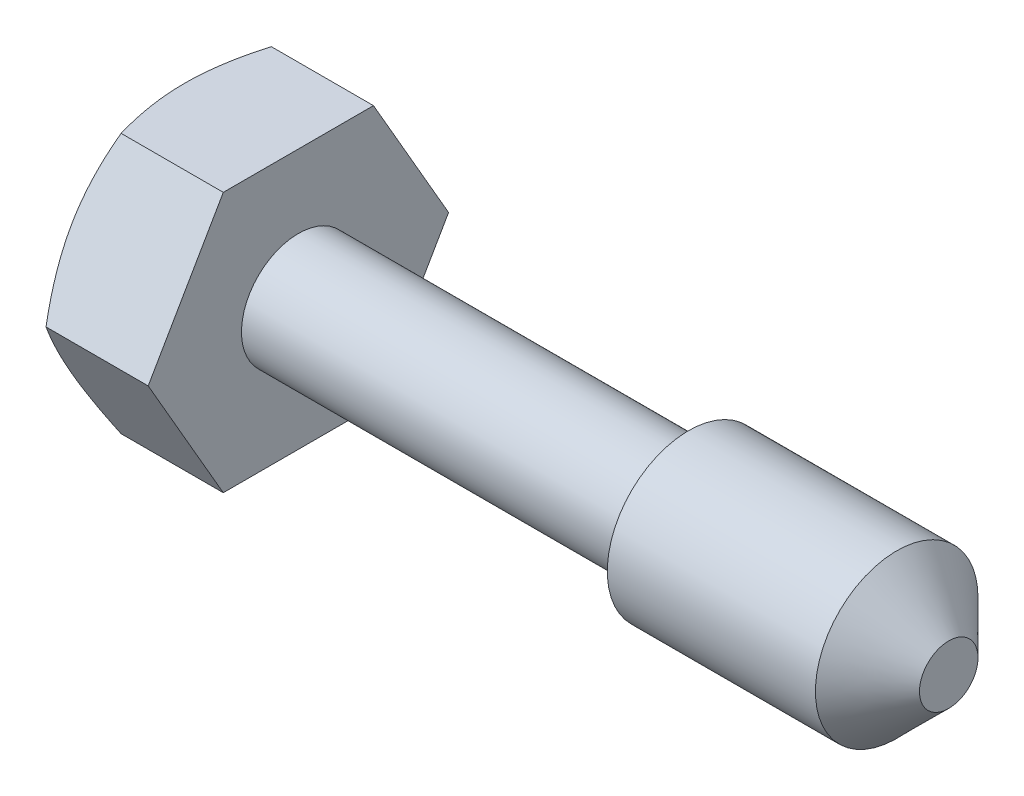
ISO-10303-21;
HEADER;
FILE_DESCRIPTION(('STEP AP214'),'2;1');
FILE_NAME('part.step','',(''),(''),'','','');
FILE_SCHEMA(('AUTOMOTIVE_DESIGN { 1 0 10303 214 1 1 1 1 }'));
ENDSEC;
DATA;
#1=APPLICATION_CONTEXT('core data for automotive mechanical design processes');
#2=APPLICATION_PROTOCOL_DEFINITION('international standard','automotive_design',2000,#1);
#3=PRODUCT_CONTEXT('',#1,'mechanical');
#4=PRODUCT('Part','Part','',(#3));
#5=PRODUCT_RELATED_PRODUCT_CATEGORY('part','',(#4));
#6=PRODUCT_DEFINITION_FORMATION('','',#4);
#7=PRODUCT_DEFINITION_CONTEXT('part definition',#1,'design');
#8=PRODUCT_DEFINITION('design','',#6,#7);
#9=PRODUCT_DEFINITION_SHAPE('','',#8);
#10=(LENGTH_UNIT() NAMED_UNIT(*) SI_UNIT(.MILLI.,.METRE.));
#11=(NAMED_UNIT(*) PLANE_ANGLE_UNIT() SI_UNIT($,.RADIAN.));
#12=(NAMED_UNIT(*) SI_UNIT($,.STERADIAN.) SOLID_ANGLE_UNIT());
#13=UNCERTAINTY_MEASURE_WITH_UNIT(LENGTH_MEASURE(1.E-05),#10,'distance_accuracy_value','');
#14=(GEOMETRIC_REPRESENTATION_CONTEXT(3) GLOBAL_UNCERTAINTY_ASSIGNED_CONTEXT((#13)) GLOBAL_UNIT_ASSIGNED_CONTEXT((#10,
#11,#12)) REPRESENTATION_CONTEXT('',''));
#15=CARTESIAN_POINT('',(0.,0.,0.));
#16=DIRECTION('',(0.,0.,1.));
#17=DIRECTION('',(1.,0.,0.));
#18=AXIS2_PLACEMENT_3D('',#15,#16,#17);
#19=CARTESIAN_POINT('',(3.5,4.,-2.3094010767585));
#20=DIRECTION('',(0.,-1.,0.));
#21=DIRECTION('',(0.,0.,-1.));
#22=AXIS2_PLACEMENT_3D('',#19,#20,#21);
#23=PLANE('',#22);
#24=CARTESIAN_POINT('',(2.00894925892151,4.,-6.32016209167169));
#25=CARTESIAN_POINT('',(1.92323607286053,4.,-6.14442149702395));
#26=CARTESIAN_POINT('',(1.83831169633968,4.,-5.96828976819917));
#27=CARTESIAN_POINT('',(1.67048205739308,4.,-5.6150364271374));
#28=CARTESIAN_POINT('',(1.58757709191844,4.,-5.43791467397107));
#29=CARTESIAN_POINT('',(1.42383542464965,4.,-5.08161610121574));
#30=CARTESIAN_POINT('',(1.34301146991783,4.,-4.90243340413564));
#31=CARTESIAN_POINT('',(1.18451928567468,4.,-4.54268290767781));
#32=CARTESIAN_POINT('',(1.10685091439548,4.,-4.36211517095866));
#33=CARTESIAN_POINT('',(0.952905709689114,4.,-3.9930904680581));
#34=CARTESIAN_POINT('',(0.876767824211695,4.,-3.80457523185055));
#35=CARTESIAN_POINT('',(0.729976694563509,4.,-3.42538286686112));
#36=CARTESIAN_POINT('',(0.659324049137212,4.,-3.23470550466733));
#37=CARTESIAN_POINT('',(0.525272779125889,4.,-2.85120603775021));
#38=CARTESIAN_POINT('',(0.461860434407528,4.,-2.65838877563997));
#39=CARTESIAN_POINT('',(0.344246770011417,4.,-2.26999073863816));
#40=CARTESIAN_POINT('',(0.29004267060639,4.,-2.07441081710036));
#41=CARTESIAN_POINT('',(0.193657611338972,4.,-1.68146389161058));
#42=CARTESIAN_POINT('',(0.151408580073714,4.,-1.48411388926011));
#43=CARTESIAN_POINT('',(0.0812431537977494,4.,-1.08684206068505));
#44=CARTESIAN_POINT('',(0.0533251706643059,4.,-0.886920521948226));
#45=CARTESIAN_POINT('',(0.0144080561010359,4.,-0.488161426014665));
#46=CARTESIAN_POINT('',(0.00318238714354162,4.,-0.289346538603));
#47=CARTESIAN_POINT('',(-0.00200277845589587,4.,0.108530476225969));
#48=CARTESIAN_POINT('',(0.00403793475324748,4.,0.307592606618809));
#49=CARTESIAN_POINT('',(0.0282615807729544,4.,0.642130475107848));
#50=CARTESIAN_POINT('',(0.0420367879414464,4.,0.777947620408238));
#51=CARTESIAN_POINT('',(0.0768287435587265,4.,1.04865722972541));
#52=CARTESIAN_POINT('',(0.0978463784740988,4.,1.18354957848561));
#53=CARTESIAN_POINT('',(0.170665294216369,4.,1.58661718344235));
#54=CARTESIAN_POINT('',(0.232221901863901,4.,1.85305348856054));
#55=CARTESIAN_POINT('',(0.339867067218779,4.,2.25169312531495));
#56=CARTESIAN_POINT('',(0.37883919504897,4.,2.38593642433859));
#57=CARTESIAN_POINT('',(0.461055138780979,4.,2.65312122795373));
#58=CARTESIAN_POINT('',(0.504298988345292,4.,2.78606272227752));
#59=CARTESIAN_POINT('',(0.594346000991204,4.,3.05068341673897));
#60=CARTESIAN_POINT('',(0.641148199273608,4.,3.18236294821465));
#61=CARTESIAN_POINT('',(0.737739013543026,4.,3.44461473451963));
#62=CARTESIAN_POINT('',(0.787527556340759,4.,3.57518701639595));
#63=CARTESIAN_POINT('',(0.927427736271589,4.,3.93177798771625));
#64=CARTESIAN_POINT('',(1.02007212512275,4.,4.15680215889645));
#65=CARTESIAN_POINT('',(1.21094437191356,4.,4.6044789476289));
#66=CARTESIAN_POINT('',(1.30917289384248,4.,4.82713127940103));
#67=CARTESIAN_POINT('',(1.50986551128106,4.,5.27061186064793));
#68=CARTESIAN_POINT('',(1.61233116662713,4.,5.4914394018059));
#69=CARTESIAN_POINT('',(1.82047752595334,4.,5.93157734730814));
#70=CARTESIAN_POINT('',(1.92615833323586,4.,6.15088770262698));
#71=CARTESIAN_POINT('',(2.1401931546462,4.,6.58864452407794));
#72=CARTESIAN_POINT('',(2.24855127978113,4.,6.80708897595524));
#73=CARTESIAN_POINT('',(2.46725135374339,4.,7.24298360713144));
#74=CARTESIAN_POINT('',(2.57759332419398,4.,7.46043377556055));
#75=CARTESIAN_POINT('',(2.91092699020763,4.,8.11147090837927));
#76=CARTESIAN_POINT('',(3.13627815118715,4.,8.54384921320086));
#77=CARTESIAN_POINT('',(3.56646247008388,4.,9.35956992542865));
#78=CARTESIAN_POINT('',(3.77086694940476,4.,9.74313951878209));
#79=CARTESIAN_POINT('',(4.18211422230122,4.,10.5090013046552));
#80=CARTESIAN_POINT('',(4.38895717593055,4.,10.8912934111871));
#81=CARTESIAN_POINT('',(4.80371780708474,4.,11.6535663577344));
#82=CARTESIAN_POINT('',(5.01162922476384,4.,12.0335506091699));
#83=CARTESIAN_POINT('',(5.42882752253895,4.,12.7927224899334));
#84=CARTESIAN_POINT('',(5.63811428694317,4.,13.1719101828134));
#85=CARTESIAN_POINT('',(5.84790058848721,4.,13.5508195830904));
#86=B_SPLINE_CURVE_WITH_KNOTS('',3,(#24,#25,#26,#27,#28,#29,#30,#31,#32,#33,#34,#35,#36,#37,#38,
#39,#40,#41,#42,#43,#44,#45,#46,#47,#48,#49,#50,#51,#52,#53,#54,#55,#56,#57,#58,#59,#60,#61,#62,
#63,#64,#65,#66,#67,#68,#69,#70,#71,#72,#73,#74,#75,#76,#77,#78,#79,#80,#81,#82,#83,#84,#85),
.UNSPECIFIED.,.F.,.F.,(4,2,2,2,2,2,2,2,2,2,2,2,2,2,2,2,2,2,2,2,2,2,2,2,2,2,2,2,2,2,4),(0.,
0.586592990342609,1.17327172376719,1.76295108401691,2.35260392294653,2.96246799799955,
3.5723985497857,4.18115341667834,4.78972418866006,5.3947566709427,5.9997220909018,
6.5963998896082,7.19308494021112,7.60243041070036,8.01182600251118,8.83100524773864,
9.25032401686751,9.66964609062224,10.0888548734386,10.5080533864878,11.2379871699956,
11.9680079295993,12.6982998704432,13.4286153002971,14.1601319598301,14.8916565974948,
16.354355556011,17.6582490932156,18.9622286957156,20.261662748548,21.5609888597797),.UNSPECIFIED.);
#87=CARTESIAN_POINT('',(0.357265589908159,4.,2.30940107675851));
#88=VERTEX_POINT('',#87);
#89=CARTESIAN_POINT('',(0.,4.,0.));
#90=VERTEX_POINT('',#89);
#91=EDGE_CURVE('E64',#88,#90,#86,.F.);
#92=ORIENTED_EDGE('',*,*,#91,.F.);
#93=DIRECTION('',(-1.,0.,0.));
#94=VECTOR('',#93,1.);
#95=CARTESIAN_POINT('',(3.5,4.,2.30940107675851));
#96=LINE('',#95,#94);
#97=CARTESIAN_POINT('',(3.5,4.,2.30940107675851));
#98=VERTEX_POINT('',#97);
#99=EDGE_CURVE('E159',#98,#88,#96,.T.);
#100=ORIENTED_EDGE('',*,*,#99,.F.);
#101=DIRECTION('',(0.,0.,1.));
#102=VECTOR('',#101,1.);
#103=CARTESIAN_POINT('',(3.5,4.,-2.3094010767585));
#104=LINE('',#103,#102);
#105=CARTESIAN_POINT('',(3.5,4.,-2.3094010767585));
#106=VERTEX_POINT('',#105);
#107=EDGE_CURVE('E294',#106,#98,#104,.T.);
#108=ORIENTED_EDGE('',*,*,#107,.F.);
#109=DIRECTION('',(-1.,0.,0.));
#110=VECTOR('',#109,1.);
#111=CARTESIAN_POINT('',(3.5,4.,-2.3094010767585));
#112=LINE('',#111,#110);
#113=CARTESIAN_POINT('',(0.357265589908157,4.,-2.3094010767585));
#114=VERTEX_POINT('',#113);
#115=EDGE_CURVE('E149',#106,#114,#112,.T.);
#116=ORIENTED_EDGE('',*,*,#115,.T.);
#117=EDGE_CURVE('E142',#90,#114,#86,.F.);
#118=ORIENTED_EDGE('',*,*,#117,.F.);
#119=EDGE_LOOP('',(#92,#100,#108,#116,#118));
#120=FACE_BOUND('',#119,.T.);
#121=ADVANCED_FACE('F50',(#120),#23,.F.);
#122=CARTESIAN_POINT('',(3.5,4.,2.30940107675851));
#123=DIRECTION('',(0.,-0.5,-0.866025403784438));
#124=DIRECTION('',(0.,0.866025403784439,-0.5));
#125=AXIS2_PLACEMENT_3D('',#122,#123,#124);
#126=PLANE('',#125);
#127=CARTESIAN_POINT('',(0.357332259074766,-0.00019999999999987,4.61891762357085));
#128=CARTESIAN_POINT('',(0.298717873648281,0.175579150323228,4.51743148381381));
#129=CARTESIAN_POINT('',(0.245410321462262,0.352875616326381,4.41506932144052));
#130=CARTESIAN_POINT('',(0.152361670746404,0.710538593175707,4.2085725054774));
#131=CARTESIAN_POINT('',(0.112653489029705,0.890911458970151,4.10443418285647));
#132=CARTESIAN_POINT('',(0.0508422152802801,1.24942181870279,3.89744813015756));
#133=CARTESIAN_POINT('',(0.0283277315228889,1.42750415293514,3.7946322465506));
#134=CARTESIAN_POINT('',(0.00145062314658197,1.78450671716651,3.58851671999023));
#135=CARTESIAN_POINT('',(-0.00293425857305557,1.9634256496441,3.48521782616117));
#136=CARTESIAN_POINT('',(0.00619007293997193,2.29774284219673,3.29219970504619));
#137=CARTESIAN_POINT('',(0.0174589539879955,2.45319115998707,3.20245157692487));
#138=CARTESIAN_POINT('',(0.0531739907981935,2.76307505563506,3.02354002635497));
#139=CARTESIAN_POINT('',(0.0776323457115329,2.91750956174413,2.93437722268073));
#140=CARTESIAN_POINT('',(0.138776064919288,3.22803232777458,2.75509682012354));
#141=CARTESIAN_POINT('',(0.175720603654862,3.3840812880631,2.6650019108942));
#142=CARTESIAN_POINT('',(0.259570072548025,3.69385183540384,2.48615580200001));
#143=CARTESIAN_POINT('',(0.306455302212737,3.84757739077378,2.39740231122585));
#144=CARTESIAN_POINT('',(0.357332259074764,4.0002,2.30928560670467));
#145=B_SPLINE_CURVE_WITH_KNOTS('',3,(#127,#128,#129,#130,#131,#132,#133,#134,#135,#136,#137,
#138,#139,#140,#141,#142,#143,#144),.UNSPECIFIED.,.F.,.F.,(4,2,2,2,2,2,2,2,4),(0.,
0.634047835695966,1.26961969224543,1.88946157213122,2.50854226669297,3.04757825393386,
3.58711366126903,4.13861653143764,4.68903648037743),.UNSPECIFIED.);
#146=CARTESIAN_POINT('',(0.357265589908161,0.,4.61880215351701));
#147=VERTEX_POINT('',#146);
#148=CARTESIAN_POINT('',(0.,2.,3.46410161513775));
#149=VERTEX_POINT('',#148);
#150=EDGE_CURVE('E68',#147,#149,#145,.T.);
#151=ORIENTED_EDGE('',*,*,#150,.F.);
#152=DIRECTION('',(-1.,0.,0.));
#153=VECTOR('',#152,1.);
#154=CARTESIAN_POINT('',(3.5,0.,4.61880215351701));
#155=LINE('',#154,#153);
#156=CARTESIAN_POINT('',(3.5,0.,4.61880215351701));
#157=VERTEX_POINT('',#156);
#158=EDGE_CURVE('E160',#157,#147,#155,.T.);
#159=ORIENTED_EDGE('',*,*,#158,.F.);
#160=DIRECTION('',(0.,-0.866025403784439,0.5));
#161=VECTOR('',#160,1.);
#162=CARTESIAN_POINT('',(3.5,4.,2.30940107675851));
#163=LINE('',#162,#161);
#164=EDGE_CURVE('E292',#98,#157,#163,.T.);
#165=ORIENTED_EDGE('',*,*,#164,.F.);
#166=ORIENTED_EDGE('',*,*,#99,.T.);
#167=EDGE_CURVE('E206',#149,#88,#145,.T.);
#168=ORIENTED_EDGE('',*,*,#167,.F.);
#169=EDGE_LOOP('',(#151,#159,#165,#166,#168));
#170=FACE_BOUND('',#169,.T.);
#171=ADVANCED_FACE('F278',(#170),#126,.F.);
#172=CARTESIAN_POINT('',(3.5,0.,4.61880215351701));
#173=DIRECTION('',(0.,0.5,-0.866025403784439));
#174=DIRECTION('',(0.,0.866025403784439,0.5));
#175=AXIS2_PLACEMENT_3D('',#172,#173,#174);
#176=PLANE('',#175);
#177=CARTESIAN_POINT('',(0.357332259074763,-4.0002,2.30928560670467));
#178=CARTESIAN_POINT('',(0.298717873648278,-3.82442084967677,2.41077174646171));
#179=CARTESIAN_POINT('',(0.245410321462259,-3.64712438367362,2.513133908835));
#180=CARTESIAN_POINT('',(0.152361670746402,-3.28946140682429,2.71963072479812));
#181=CARTESIAN_POINT('',(0.112653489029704,-3.10908854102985,2.82376904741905));
#182=CARTESIAN_POINT('',(0.0508422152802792,-2.75057818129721,3.03075510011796));
#183=CARTESIAN_POINT('',(0.0283277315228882,-2.57249584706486,3.13357098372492));
#184=CARTESIAN_POINT('',(0.00145062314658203,-2.21549328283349,3.33968651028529));
#185=CARTESIAN_POINT('',(-0.00293425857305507,-2.0365743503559,3.44298540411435));
#186=CARTESIAN_POINT('',(0.00619007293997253,-1.70225715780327,3.63600352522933));
#187=CARTESIAN_POINT('',(0.0174589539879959,-1.54680884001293,3.72575165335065));
#188=CARTESIAN_POINT('',(0.0531739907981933,-1.23692494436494,3.90466320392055));
#189=CARTESIAN_POINT('',(0.0776323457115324,-1.08249043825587,3.99382600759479));
#190=CARTESIAN_POINT('',(0.138776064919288,-0.771967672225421,4.17310641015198));
#191=CARTESIAN_POINT('',(0.175720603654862,-0.615918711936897,4.26320131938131));
#192=CARTESIAN_POINT('',(0.259570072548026,-0.30614816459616,4.44204742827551));
#193=CARTESIAN_POINT('',(0.306455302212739,-0.15242260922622,4.53080091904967));
#194=CARTESIAN_POINT('',(0.357332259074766,0.000199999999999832,4.61891762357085));
#195=B_SPLINE_CURVE_WITH_KNOTS('',3,(#177,#178,#179,#180,#181,#182,#183,#184,#185,#186,#187,
#188,#189,#190,#191,#192,#193,#194),.UNSPECIFIED.,.F.,.F.,(4,2,2,2,2,2,2,2,4),(0.,
0.634047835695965,1.26961969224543,1.88946157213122,2.50854226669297,3.04757825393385,
3.58711366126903,4.13861653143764,4.68903648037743),.UNSPECIFIED.);
#196=CARTESIAN_POINT('',(0.357265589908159,-4.,2.30940107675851));
#197=VERTEX_POINT('',#196);
#198=CARTESIAN_POINT('',(0.,-2.,3.46410161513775));
#199=VERTEX_POINT('',#198);
#200=EDGE_CURVE('E194',#197,#199,#195,.T.);
#201=ORIENTED_EDGE('',*,*,#200,.F.);
#202=DIRECTION('',(-1.,0.,0.));
#203=VECTOR('',#202,1.);
#204=CARTESIAN_POINT('',(3.5,-4.,2.30940107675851));
#205=LINE('',#204,#203);
#206=CARTESIAN_POINT('',(3.5,-4.,2.30940107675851));
#207=VERTEX_POINT('',#206);
#208=EDGE_CURVE('E146',#207,#197,#205,.T.);
#209=ORIENTED_EDGE('',*,*,#208,.F.);
#210=DIRECTION('',(0.,-0.866025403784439,-0.5));
#211=VECTOR('',#210,1.);
#212=CARTESIAN_POINT('',(3.5,0.,4.61880215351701));
#213=LINE('',#212,#211);
#214=EDGE_CURVE('E295',#157,#207,#213,.T.);
#215=ORIENTED_EDGE('',*,*,#214,.F.);
#216=ORIENTED_EDGE('',*,*,#158,.T.);
#217=EDGE_CURVE('E185',#199,#147,#195,.T.);
#218=ORIENTED_EDGE('',*,*,#217,.F.);
#219=EDGE_LOOP('',(#201,#209,#215,#216,#218));
#220=FACE_BOUND('',#219,.T.);
#221=ADVANCED_FACE('F188',(#220),#176,.F.);
#222=CARTESIAN_POINT('',(3.5,-4.,2.30940107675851));
#223=DIRECTION('',(0.,1.,0.));
#224=DIRECTION('',(0.,0.,1.));
#225=AXIS2_PLACEMENT_3D('',#222,#223,#224);
#226=PLANE('',#225);
#227=CARTESIAN_POINT('',(2.00894926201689,-4.,-6.32016209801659));
#228=CARTESIAN_POINT('',(1.92323607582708,-4.,-6.14442150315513));
#229=CARTESIAN_POINT('',(1.83831169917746,-4.,-5.96828977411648));
#230=CARTESIAN_POINT('',(1.67048205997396,-4.,-5.61503643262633));
#231=CARTESIAN_POINT('',(1.58757709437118,-4.,-5.43791467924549));
#232=CARTESIAN_POINT('',(1.42383542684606,-4.,-5.08161610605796));
#233=CARTESIAN_POINT('',(1.34301147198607,-4.,-4.90243340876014));
#234=CARTESIAN_POINT('',(1.18451928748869,-4.,-4.54268291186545));
#235=CARTESIAN_POINT('',(1.10685091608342,-4.,-4.36211517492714));
#236=CARTESIAN_POINT('',(0.952905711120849,-4.,-3.99309047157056));
#237=CARTESIAN_POINT('',(0.876767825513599,-4.,-3.80457523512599));
#238=CARTESIAN_POINT('',(0.729976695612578,-4.,-3.42538286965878));
#239=CARTESIAN_POINT('',(0.659324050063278,-4.,-3.23470550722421));
#240=CARTESIAN_POINT('',(0.525272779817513,-4.,-2.85120603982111));
#241=CARTESIAN_POINT('',(0.461860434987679,-4.,-2.65838877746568));
#242=CARTESIAN_POINT('',(0.344246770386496,-4.,-2.26999073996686));
#243=CARTESIAN_POINT('',(0.29004267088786,-4.,-2.07441081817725));
#244=CARTESIAN_POINT('',(0.193657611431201,-4.,-1.68146389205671));
#245=CARTESIAN_POINT('',(0.151408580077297,-4.,-1.48411388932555));
#246=CARTESIAN_POINT('',(0.0812431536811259,-4.,-1.08684205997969));
#247=CARTESIAN_POINT('',(0.0533251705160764,-4.,-0.886920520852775));
#248=CARTESIAN_POINT('',(0.0144080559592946,-4.,-0.488161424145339));
#249=CARTESIAN_POINT('',(0.00318238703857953,-4.,-0.289346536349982));
#250=CARTESIAN_POINT('',(-0.00200277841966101,-4.,0.108530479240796));
#251=CARTESIAN_POINT('',(0.00403793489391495,-4.,0.307592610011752));
#252=CARTESIAN_POINT('',(0.0282615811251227,-4.,0.642130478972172));
#253=CARTESIAN_POINT('',(0.0420367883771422,-4.,0.777947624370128));
#254=CARTESIAN_POINT('',(0.0768287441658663,-4.,1.04865723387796));
#255=CARTESIAN_POINT('',(0.097846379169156,-4.,1.18354958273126));
#256=CARTESIAN_POINT('',(0.170665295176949,-4.,1.58661718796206));
#257=CARTESIAN_POINT('',(0.232221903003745,-4.,1.85305349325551));
#258=CARTESIAN_POINT('',(0.339867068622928,-4.,2.25169313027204));
#259=CARTESIAN_POINT('',(0.378839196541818,-4.,2.385936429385));
#260=CARTESIAN_POINT('',(0.461055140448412,-4.,2.65312123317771));
#261=CARTESIAN_POINT('',(0.504298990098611,-4.,2.78606272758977));
#262=CARTESIAN_POINT('',(0.59434600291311,-4.,3.05068342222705));
#263=CARTESIAN_POINT('',(0.641148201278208,-4.,3.1823629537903));
#264=CARTESIAN_POINT('',(0.737739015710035,-4.,3.44461474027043));
#265=CARTESIAN_POINT('',(0.787527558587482,-4.,3.57518702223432));
#266=CARTESIAN_POINT('',(0.927427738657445,-4.,3.93177799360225));
#267=CARTESIAN_POINT('',(1.02007212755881,-4.,4.15680216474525));
#268=CARTESIAN_POINT('',(1.21094437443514,-4.,4.60447895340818));
#269=CARTESIAN_POINT('',(1.30917289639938,-4.,4.82713128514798));
#270=CARTESIAN_POINT('',(1.50986551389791,-4.,5.27061186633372));
#271=CARTESIAN_POINT('',(1.6123311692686,-4.,5.49143940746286));
#272=CARTESIAN_POINT('',(1.8204775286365,-4.,5.93157735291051));
#273=CARTESIAN_POINT('',(1.92615833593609,-4.,6.15088770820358));
#274=CARTESIAN_POINT('',(2.14019315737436,-4.,6.58864452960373));
#275=CARTESIAN_POINT('',(2.2485512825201,-4.,6.80708898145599));
#276=CARTESIAN_POINT('',(2.4672513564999,-4.,7.24298361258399));
#277=CARTESIAN_POINT('',(2.57759332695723,-4.,7.46043378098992));
#278=CARTESIAN_POINT('',(2.91092699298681,-4.,8.11147091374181));
#279=CARTESIAN_POINT('',(3.13627815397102,-4.,8.54384921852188));
#280=CARTESIAN_POINT('',(3.56646247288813,-4.,9.35956993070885));
#281=CARTESIAN_POINT('',(3.77086695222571,-4.,9.74313952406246));
#282=CARTESIAN_POINT('',(4.18211422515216,-4.,10.5090013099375));
#283=CARTESIAN_POINT('',(4.38895717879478,-4.,10.8912934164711));
#284=CARTESIAN_POINT('',(4.8037178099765,-4.,11.6535663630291));
#285=CARTESIAN_POINT('',(5.01162922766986,-4.,12.0335506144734));
#286=CARTESIAN_POINT('',(5.42882752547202,-4.,12.7927224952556));
#287=CARTESIAN_POINT('',(5.63811428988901,-4.,13.1719101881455));
#288=CARTESIAN_POINT('',(5.84790059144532,-4.,13.5508195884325));
#289=B_SPLINE_CURVE_WITH_KNOTS('',3,(#227,#228,#229,#230,#231,#232,#233,#234,#235,#236,#237,
#238,#239,#240,#241,#242,#243,#244,#245,#246,#247,#248,#249,#250,#251,#252,#253,#254,#255,#256,
#257,#258,#259,#260,#261,#262,#263,#264,#265,#266,#267,#268,#269,#270,#271,#272,#273,#274,#275,
#276,#277,#278,#279,#280,#281,#282,#283,#284,#285,#286,#287,#288),.UNSPECIFIED.,.F.,.F.,(4,2,2,
2,2,2,2,2,2,2,2,2,2,2,2,2,2,2,2,2,2,2,2,2,2,2,2,2,2,2,4),(0.,0.586592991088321,1.17327172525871,
1.76295108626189,2.35260392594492,2.96246800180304,3.57239855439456,4.18115342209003,
4.78972419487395,5.39475667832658,5.99972209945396,6.59639989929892,7.19308495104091,
7.60243042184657,8.01182601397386,8.83100525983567,9.25032402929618,9.66964610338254,
10.0888548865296,10.5080533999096,11.2379871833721,11.9680079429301,12.6982998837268,
13.4286153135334,14.1601319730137,14.8916566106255,16.3543555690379,17.6582491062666,
18.9622287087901,20.2616627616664,21.5609888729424),.UNSPECIFIED.);
#290=CARTESIAN_POINT('',(0.357265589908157,-4.,-2.3094010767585));
#291=VERTEX_POINT('',#290);
#292=CARTESIAN_POINT('',(0.,-4.,0.));
#293=VERTEX_POINT('',#292);
#294=EDGE_CURVE('E196',#291,#293,#289,.T.);
#295=ORIENTED_EDGE('',*,*,#294,.F.);
#296=DIRECTION('',(-1.,0.,0.));
#297=VECTOR('',#296,1.);
#298=CARTESIAN_POINT('',(3.5,-4.,-2.3094010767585));
#299=LINE('',#298,#297);
#300=CARTESIAN_POINT('',(3.5,-4.,-2.3094010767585));
#301=VERTEX_POINT('',#300);
#302=EDGE_CURVE('E147',#301,#291,#299,.T.);
#303=ORIENTED_EDGE('',*,*,#302,.F.);
#304=DIRECTION('',(0.,0.,-1.));
#305=VECTOR('',#304,1.);
#306=CARTESIAN_POINT('',(3.5,-4.,2.30940107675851));
#307=LINE('',#306,#305);
#308=EDGE_CURVE('E303',#207,#301,#307,.T.);
#309=ORIENTED_EDGE('',*,*,#308,.F.);
#310=ORIENTED_EDGE('',*,*,#208,.T.);
#311=EDGE_CURVE('E193',#293,#197,#289,.T.);
#312=ORIENTED_EDGE('',*,*,#311,.F.);
#313=EDGE_LOOP('',(#295,#303,#309,#310,#312));
#314=FACE_BOUND('',#313,.T.);
#315=ADVANCED_FACE('F248',(#314),#226,.F.);
#316=CARTESIAN_POINT('',(3.5,-4.,-2.3094010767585));
#317=DIRECTION('',(0.,0.5,0.866025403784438));
#318=DIRECTION('',(0.,-0.866025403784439,0.5));
#319=AXIS2_PLACEMENT_3D('',#316,#317,#318);
#320=PLANE('',#319);
#321=CARTESIAN_POINT('',(0.357332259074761,0.000199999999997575,-4.61891762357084));
#322=CARTESIAN_POINT('',(0.298717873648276,-0.17557915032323,-4.5174314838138));
#323=CARTESIAN_POINT('',(0.245410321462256,-0.352875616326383,-4.41506932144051));
#324=CARTESIAN_POINT('',(0.152361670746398,-0.710538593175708,-4.20857250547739));
#325=CARTESIAN_POINT('',(0.1126534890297,-0.890911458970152,-4.10443418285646));
#326=CARTESIAN_POINT('',(0.0508422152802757,-1.24942181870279,-3.89744813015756));
#327=CARTESIAN_POINT('',(0.0283277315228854,-1.42750415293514,-3.79463224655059));
#328=CARTESIAN_POINT('',(0.00145062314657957,-1.78450671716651,-3.58851671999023));
#329=CARTESIAN_POINT('',(-0.00293425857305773,-1.9634256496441,-3.48521782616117));
#330=CARTESIAN_POINT('',(0.00619007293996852,-2.29774284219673,-3.29219970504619));
#331=CARTESIAN_POINT('',(0.0174589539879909,-2.45319115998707,-3.20245157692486));
#332=CARTESIAN_POINT('',(0.0531739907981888,-2.76307505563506,-3.02354002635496));
#333=CARTESIAN_POINT('',(0.0776323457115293,-2.91750956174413,-2.93437722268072));
#334=CARTESIAN_POINT('',(0.138776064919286,-3.22803232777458,-2.75509682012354));
#335=CARTESIAN_POINT('',(0.17572060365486,-3.3840812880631,-2.6650019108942));
#336=CARTESIAN_POINT('',(0.259570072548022,-3.69385183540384,-2.486155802));
#337=CARTESIAN_POINT('',(0.306455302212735,-3.84757739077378,-2.39740231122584));
#338=CARTESIAN_POINT('',(0.357332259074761,-4.0002,-2.30928560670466));
#339=B_SPLINE_CURVE_WITH_KNOTS('',3,(#321,#322,#323,#324,#325,#326,#327,#328,#329,#330,#331,
#332,#333,#334,#335,#336,#337,#338),.UNSPECIFIED.,.F.,.F.,(4,2,2,2,2,2,2,2,4),(0.,
0.634047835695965,1.26961969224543,1.88946157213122,2.50854226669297,3.04757825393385,
3.58711366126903,4.13861653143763,4.68903648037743),.UNSPECIFIED.);
#340=CARTESIAN_POINT('',(0.357265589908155,0.,-4.618802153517));
#341=VERTEX_POINT('',#340);
#342=CARTESIAN_POINT('',(0.,-2.,-3.46410161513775));
#343=VERTEX_POINT('',#342);
#344=EDGE_CURVE('E124',#341,#343,#339,.T.);
#345=ORIENTED_EDGE('',*,*,#344,.F.);
#346=DIRECTION('',(-1.,0.,0.));
#347=VECTOR('',#346,1.);
#348=CARTESIAN_POINT('',(3.5,0.,-4.618802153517));
#349=LINE('',#348,#347);
#350=CARTESIAN_POINT('',(3.5,0.,-4.618802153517));
#351=VERTEX_POINT('',#350);
#352=EDGE_CURVE('E140',#351,#341,#349,.T.);
#353=ORIENTED_EDGE('',*,*,#352,.F.);
#354=DIRECTION('',(0.,0.866025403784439,-0.5));
#355=VECTOR('',#354,1.);
#356=CARTESIAN_POINT('',(3.5,-4.,-2.3094010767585));
#357=LINE('',#356,#355);
#358=EDGE_CURVE('E304',#301,#351,#357,.T.);
#359=ORIENTED_EDGE('',*,*,#358,.F.);
#360=ORIENTED_EDGE('',*,*,#302,.T.);
#361=EDGE_CURVE('E139',#343,#291,#339,.T.);
#362=ORIENTED_EDGE('',*,*,#361,.F.);
#363=EDGE_LOOP('',(#345,#353,#359,#360,#362));
#364=FACE_BOUND('',#363,.T.);
#365=ADVANCED_FACE('F133',(#364),#320,.F.);
#366=CARTESIAN_POINT('',(3.5,0.,-4.618802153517));
#367=DIRECTION('',(0.,-0.5,0.866025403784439));
#368=DIRECTION('',(0.,-0.866025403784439,-0.5));
#369=AXIS2_PLACEMENT_3D('',#366,#367,#368);
#370=PLANE('',#369);
#371=CARTESIAN_POINT('',(0.357332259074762,4.0002,-2.30928560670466));
#372=CARTESIAN_POINT('',(0.298717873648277,3.82442084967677,-2.4107717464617));
#373=CARTESIAN_POINT('',(0.245410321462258,3.64712438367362,-2.51313390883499));
#374=CARTESIAN_POINT('',(0.152361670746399,3.28946140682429,-2.71963072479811));
#375=CARTESIAN_POINT('',(0.1126534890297,3.10908854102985,-2.82376904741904));
#376=CARTESIAN_POINT('',(0.0508422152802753,2.75057818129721,-3.03075510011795));
#377=CARTESIAN_POINT('',(0.0283277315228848,2.57249584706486,-3.13357098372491));
#378=CARTESIAN_POINT('',(0.0014506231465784,2.21549328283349,-3.33968651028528));
#379=CARTESIAN_POINT('',(-0.0029342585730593,2.0365743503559,-3.44298540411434));
#380=CARTESIAN_POINT('',(0.00619007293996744,1.70225715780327,-3.63600352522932));
#381=CARTESIAN_POINT('',(0.0174589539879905,1.54680884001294,-3.72575165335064));
#382=CARTESIAN_POINT('',(0.053173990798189,1.23692494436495,-3.90466320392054));
#383=CARTESIAN_POINT('',(0.0776323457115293,1.08249043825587,-3.99382600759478));
#384=CARTESIAN_POINT('',(0.138776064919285,0.771967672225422,-4.17310641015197));
#385=CARTESIAN_POINT('',(0.175720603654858,0.615918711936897,-4.26320131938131));
#386=CARTESIAN_POINT('',(0.25957007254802,0.306148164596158,-4.4420474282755));
#387=CARTESIAN_POINT('',(0.306455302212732,0.152422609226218,-4.53080091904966));
#388=CARTESIAN_POINT('',(0.35733225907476,-0.000200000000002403,-4.61891762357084));
#389=B_SPLINE_CURVE_WITH_KNOTS('',3,(#371,#372,#373,#374,#375,#376,#377,#378,#379,#380,#381,
#382,#383,#384,#385,#386,#387,#388),.UNSPECIFIED.,.F.,.F.,(4,2,2,2,2,2,2,2,4),(0.,
0.634047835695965,1.26961969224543,1.88946157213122,2.50854226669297,3.04757825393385,
3.58711366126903,4.13861653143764,4.68903648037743),.UNSPECIFIED.);
#390=CARTESIAN_POINT('',(0.,2.,-3.46410161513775));
#391=VERTEX_POINT('',#390);
#392=EDGE_CURVE('E126',#114,#391,#389,.T.);
#393=ORIENTED_EDGE('',*,*,#392,.F.);
#394=ORIENTED_EDGE('',*,*,#115,.F.);
#395=DIRECTION('',(0.,0.866025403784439,0.5));
#396=VECTOR('',#395,1.);
#397=CARTESIAN_POINT('',(3.5,0.,-4.618802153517));
#398=LINE('',#397,#396);
#399=EDGE_CURVE('E143',#351,#106,#398,.T.);
#400=ORIENTED_EDGE('',*,*,#399,.F.);
#401=ORIENTED_EDGE('',*,*,#352,.T.);
#402=EDGE_CURVE('E119',#391,#341,#389,.T.);
#403=ORIENTED_EDGE('',*,*,#402,.F.);
#404=EDGE_LOOP('',(#393,#394,#400,#401,#403));
#405=FACE_BOUND('',#404,.T.);
#406=ADVANCED_FACE('F141',(#405),#370,.F.);
#407=CARTESIAN_POINT('',(23.4999999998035,0.,0.));
#408=DIRECTION('',(-1.,0.,0.));
#409=DIRECTION('',(0.,0.,1.));
#410=AXIS2_PLACEMENT_3D('',#407,#408,#409);
#411=CYLINDRICAL_SURFACE('',#410,1.75);
#412=CARTESIAN_POINT('',(3.49999999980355,0.,0.));
#413=DIRECTION('',(1.,0.,0.));
#414=DIRECTION('',(0.,0.,-1.));
#415=AXIS2_PLACEMENT_3D('',#412,#413,#414);
#416=CIRCLE('',#415,1.75);
#417=CARTESIAN_POINT('',(3.49999999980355,0.,-1.75));
#418=VERTEX_POINT('',#417);
#419=EDGE_CURVE('E296',#418,#418,#416,.T.);
#420=ORIENTED_EDGE('',*,*,#419,.T.);
#421=EDGE_LOOP('',(#420));
#422=FACE_BOUND('',#421,.T.);
#423=CARTESIAN_POINT('',(15.4999999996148,0.,0.));
#424=DIRECTION('',(1.,0.,0.));
#425=DIRECTION('',(0.,0.,-1.));
#426=AXIS2_PLACEMENT_3D('',#423,#424,#425);
#427=CIRCLE('',#426,1.75);
#428=CARTESIAN_POINT('',(15.4999999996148,0.,-1.75));
#429=VERTEX_POINT('',#428);
#430=EDGE_CURVE('E161',#429,#429,#427,.T.);
#431=ORIENTED_EDGE('',*,*,#430,.F.);
#432=EDGE_LOOP('',(#431));
#433=FACE_BOUND('',#432,.T.);
#434=ADVANCED_FACE('F260',(#422,#433),#411,.T.);
#435=CARTESIAN_POINT('',(3.5,4.,6.92820323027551));
#436=DIRECTION('',(1.,0.,0.));
#437=DIRECTION('',(0.,0.,-1.));
#438=AXIS2_PLACEMENT_3D('',#435,#436,#437);
#439=PLANE('',#438);
#440=ORIENTED_EDGE('',*,*,#107,.T.);
#441=ORIENTED_EDGE('',*,*,#164,.T.);
#442=ORIENTED_EDGE('',*,*,#214,.T.);
#443=ORIENTED_EDGE('',*,*,#308,.T.);
#444=ORIENTED_EDGE('',*,*,#358,.T.);
#445=ORIENTED_EDGE('',*,*,#399,.T.);
#446=EDGE_LOOP('',(#440,#441,#442,#443,#444,#445));
#447=FACE_BOUND('',#446,.T.);
#448=ORIENTED_EDGE('',*,*,#419,.F.);
#449=EDGE_LOOP('',(#448));
#450=FACE_BOUND('',#449,.T.);
#451=ADVANCED_FACE('F264',(#447,#450),#439,.T.);
#452=CARTESIAN_POINT('',(15.4999999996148,0.,0.));
#453=DIRECTION('',(1.,0.,0.));
#454=DIRECTION('',(0.,0.,-1.));
#455=AXIS2_PLACEMENT_3D('',#452,#453,#454);
#456=PLANE('',#455);
#457=CARTESIAN_POINT('',(15.4999999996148,0.,0.));
#458=DIRECTION('',(1.,0.,0.));
#459=DIRECTION('',(0.,0.,-1.));
#460=AXIS2_PLACEMENT_3D('',#457,#458,#459);
#461=CIRCLE('',#460,2.5);
#462=CARTESIAN_POINT('',(15.4999999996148,0.,-2.5));
#463=VERTEX_POINT('',#462);
#464=EDGE_CURVE('E199',#463,#463,#461,.T.);
#465=ORIENTED_EDGE('',*,*,#464,.F.);
#466=EDGE_LOOP('',(#465));
#467=FACE_BOUND('',#466,.T.);
#468=ORIENTED_EDGE('',*,*,#430,.T.);
#469=EDGE_LOOP('',(#468));
#470=FACE_BOUND('',#469,.T.);
#471=ADVANCED_FACE('F225',(#467,#470),#456,.F.);
#472=CARTESIAN_POINT('',(15.4999999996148,0.,0.));
#473=DIRECTION('',(1.,0.,0.));
#474=DIRECTION('',(0.,0.,-1.));
#475=AXIS2_PLACEMENT_3D('',#472,#473,#474);
#476=CYLINDRICAL_SURFACE('',#475,2.5);
#477=CARTESIAN_POINT('',(21.8999999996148,0.,0.));
#478=DIRECTION('',(1.,0.,0.));
#479=DIRECTION('',(0.,0.,-1.));
#480=AXIS2_PLACEMENT_3D('',#477,#478,#479);
#481=CIRCLE('',#480,2.5);
#482=CARTESIAN_POINT('',(21.8999999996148,0.,-2.5));
#483=VERTEX_POINT('',#482);
#484=EDGE_CURVE('E166',#483,#483,#481,.F.);
#485=ORIENTED_EDGE('',*,*,#484,.T.);
#486=EDGE_LOOP('',(#485));
#487=FACE_BOUND('',#486,.T.);
#488=ORIENTED_EDGE('',*,*,#464,.T.);
#489=EDGE_LOOP('',(#488));
#490=FACE_BOUND('',#489,.T.);
#491=ADVANCED_FACE('F272',(#487,#490),#476,.T.);
#492=CARTESIAN_POINT('',(23.4999999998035,0.,0.));
#493=DIRECTION('',(1.,0.,0.));
#494=DIRECTION('',(0.,0.,-1.));
#495=AXIS2_PLACEMENT_3D('',#492,#493,#494);
#496=PLANE('',#495);
#497=CARTESIAN_POINT('',(23.4999999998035,0.,0.));
#498=DIRECTION('',(1.,0.,0.));
#499=DIRECTION('',(0.,0.,-1.));
#500=AXIS2_PLACEMENT_3D('',#497,#498,#499);
#501=CIRCLE('',#500,0.899999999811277);
#502=CARTESIAN_POINT('',(23.4999999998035,0.,-0.899999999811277));
#503=VERTEX_POINT('',#502);
#504=EDGE_CURVE('E168',#503,#503,#501,.T.);
#505=ORIENTED_EDGE('',*,*,#504,.T.);
#506=EDGE_LOOP('',(#505));
#507=FACE_BOUND('',#506,.T.);
#508=ADVANCED_FACE('F267',(#507),#496,.T.);
#509=CARTESIAN_POINT('',(23.4999999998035,0.,0.));
#510=DIRECTION('',(-1.,0.,0.));
#511=DIRECTION('',(0.,0.,1.));
#512=AXIS2_PLACEMENT_3D('',#509,#510,#511);
#513=CONICAL_SURFACE('',#512,0.899999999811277,0.785398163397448);
#514=ORIENTED_EDGE('',*,*,#484,.F.);
#515=EDGE_LOOP('',(#514));
#516=FACE_BOUND('',#515,.T.);
#517=ORIENTED_EDGE('',*,*,#504,.F.);
#518=EDGE_LOOP('',(#517));
#519=FACE_BOUND('',#518,.T.);
#520=ADVANCED_FACE('F47',(#516,#519),#513,.T.);
#521=CARTESIAN_POINT('',(6.13076828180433,0.,0.));
#522=DIRECTION('',(1.,0.,0.));
#523=DIRECTION('',(0.,0.,-1.));
#524=AXIS2_PLACEMENT_3D('',#521,#522,#523);
#525=CONICAL_SURFACE('',#524,14.618802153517,1.0471975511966);
#526=ORIENTED_EDGE('',*,*,#344,.T.);
#527=CARTESIAN_POINT('',(0.,0.,0.));
#528=DIRECTION('',(1.,0.,0.));
#529=DIRECTION('',(0.,0.,-1.));
#530=AXIS2_PLACEMENT_3D('',#527,#528,#529);
#531=CIRCLE('',#530,4.);
#532=EDGE_CURVE('E51',#343,#391,#531,.T.);
#533=ORIENTED_EDGE('',*,*,#532,.T.);
#534=ORIENTED_EDGE('',*,*,#402,.T.);
#535=EDGE_LOOP('',(#526,#533,#534));
#536=FACE_BOUND('',#535,.T.);
#537=ADVANCED_FACE('F125',(#536),#525,.T.);
#538=ORIENTED_EDGE('',*,*,#294,.T.);
#539=EDGE_CURVE('E175',#293,#343,#531,.T.);
#540=ORIENTED_EDGE('',*,*,#539,.T.);
#541=ORIENTED_EDGE('',*,*,#361,.T.);
#542=EDGE_LOOP('',(#538,#540,#541));
#543=FACE_BOUND('',#542,.T.);
#544=ADVANCED_FACE('F221',(#543),#525,.T.);
#545=ORIENTED_EDGE('',*,*,#200,.T.);
#546=EDGE_CURVE('E173',#199,#293,#531,.T.);
#547=ORIENTED_EDGE('',*,*,#546,.T.);
#548=ORIENTED_EDGE('',*,*,#311,.T.);
#549=EDGE_LOOP('',(#545,#547,#548));
#550=FACE_BOUND('',#549,.T.);
#551=ADVANCED_FACE('F219',(#550),#525,.T.);
#552=ORIENTED_EDGE('',*,*,#217,.T.);
#553=ORIENTED_EDGE('',*,*,#150,.T.);
#554=EDGE_CURVE('E57',#149,#199,#531,.T.);
#555=ORIENTED_EDGE('',*,*,#554,.T.);
#556=EDGE_LOOP('',(#552,#553,#555));
#557=FACE_BOUND('',#556,.T.);
#558=ADVANCED_FACE('F179',(#557),#525,.T.);
#559=ORIENTED_EDGE('',*,*,#167,.T.);
#560=ORIENTED_EDGE('',*,*,#91,.T.);
#561=EDGE_CURVE('E11',#90,#149,#531,.T.);
#562=ORIENTED_EDGE('',*,*,#561,.T.);
#563=EDGE_LOOP('',(#559,#560,#562));
#564=FACE_BOUND('',#563,.T.);
#565=ADVANCED_FACE('F309',(#564),#525,.T.);
#566=ORIENTED_EDGE('',*,*,#117,.T.);
#567=ORIENTED_EDGE('',*,*,#392,.T.);
#568=CARTESIAN_POINT('',(0.,0.,0.));
#569=DIRECTION('',(1.,0.,0.));
#570=DIRECTION('',(0.,0.,-1.));
#571=AXIS2_PLACEMENT_3D('',#568,#569,#570);
#572=CIRCLE('',#571,4.);
#573=EDGE_CURVE('E128',#391,#90,#572,.T.);
#574=ORIENTED_EDGE('',*,*,#573,.T.);
#575=EDGE_LOOP('',(#566,#567,#574));
#576=FACE_BOUND('',#575,.T.);
#577=ADVANCED_FACE('F262',(#576),#525,.T.);
#578=CARTESIAN_POINT('',(0.,4.,6.92820323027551));
#579=DIRECTION('',(1.,0.,0.));
#580=DIRECTION('',(0.,0.,-1.));
#581=AXIS2_PLACEMENT_3D('',#578,#579,#580);
#582=PLANE('',#581);
#583=ORIENTED_EDGE('',*,*,#573,.F.);
#584=ORIENTED_EDGE('',*,*,#532,.F.);
#585=ORIENTED_EDGE('',*,*,#539,.F.);
#586=ORIENTED_EDGE('',*,*,#546,.F.);
#587=ORIENTED_EDGE('',*,*,#554,.F.);
#588=ORIENTED_EDGE('',*,*,#561,.F.);
#589=EDGE_LOOP('',(#583,#584,#585,#586,#587,#588));
#590=FACE_BOUND('',#589,.T.);
#591=ADVANCED_FACE('F187',(#590),#582,.F.);
#592=CLOSED_SHELL('',(#121,#171,#221,#315,#365,#406,#434,#451,#471,#491,#508,#520,#537,#544,
#551,#558,#565,#577,#591));
#593=MANIFOLD_SOLID_BREP('B2',#592);
#594=ADVANCED_BREP_SHAPE_REPRESENTATION('',(#18,#593),#14);
#595=SHAPE_DEFINITION_REPRESENTATION(#9,#594);
ENDSEC;
END-ISO-10303-21;
